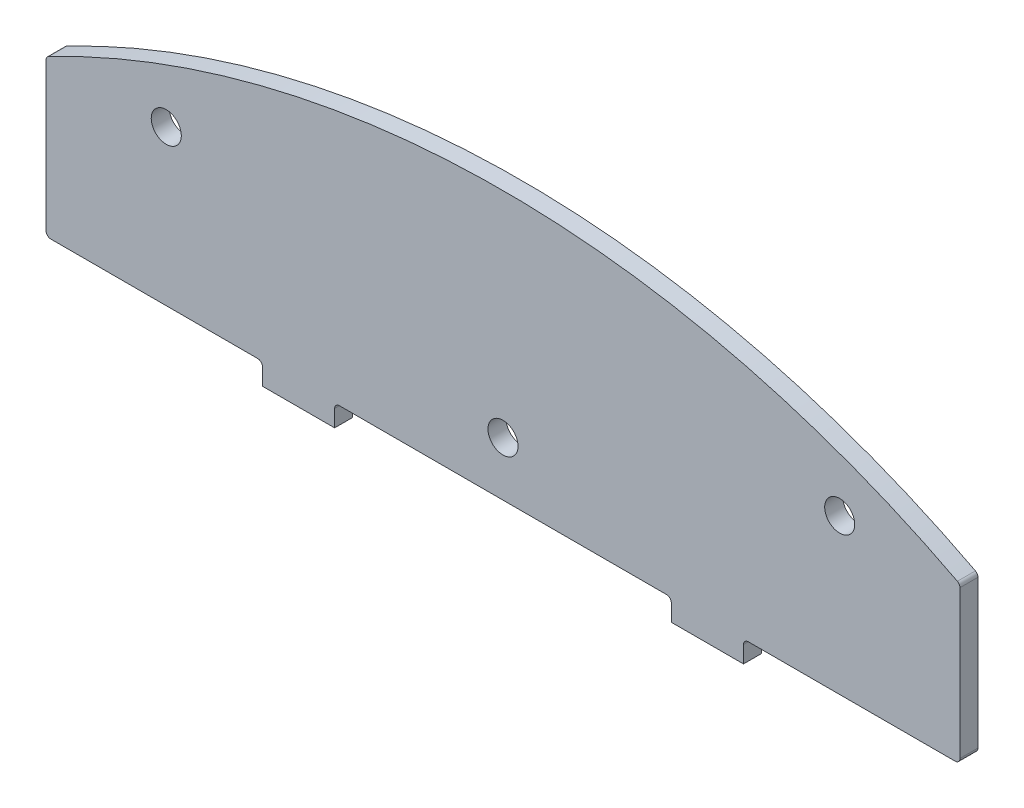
ISO-10303-21;
HEADER;
FILE_DESCRIPTION(('STEP AP214'),'2;1');
FILE_NAME('part.step','',(''),(''),'','','');
FILE_SCHEMA(('AUTOMOTIVE_DESIGN { 1 0 10303 214 1 1 1 1 }'));
ENDSEC;
DATA;
#1=APPLICATION_CONTEXT('core data for automotive mechanical design processes');
#2=APPLICATION_PROTOCOL_DEFINITION('international standard','automotive_design',2000,#1);
#3=PRODUCT_CONTEXT('',#1,'mechanical');
#4=PRODUCT('Part','Part','',(#3));
#5=PRODUCT_RELATED_PRODUCT_CATEGORY('part','',(#4));
#6=PRODUCT_DEFINITION_FORMATION('','',#4);
#7=PRODUCT_DEFINITION_CONTEXT('part definition',#1,'design');
#8=PRODUCT_DEFINITION('design','',#6,#7);
#9=PRODUCT_DEFINITION_SHAPE('','',#8);
#10=(LENGTH_UNIT() NAMED_UNIT(*) SI_UNIT(.MILLI.,.METRE.));
#11=(NAMED_UNIT(*) PLANE_ANGLE_UNIT() SI_UNIT($,.RADIAN.));
#12=(NAMED_UNIT(*) SI_UNIT($,.STERADIAN.) SOLID_ANGLE_UNIT());
#13=UNCERTAINTY_MEASURE_WITH_UNIT(LENGTH_MEASURE(1.E-05),#10,'distance_accuracy_value','');
#14=(GEOMETRIC_REPRESENTATION_CONTEXT(3) GLOBAL_UNCERTAINTY_ASSIGNED_CONTEXT((#13)) GLOBAL_UNIT_ASSIGNED_CONTEXT((#10,
#11,#12)) REPRESENTATION_CONTEXT('',''));
#15=CARTESIAN_POINT('',(0.,0.,0.));
#16=DIRECTION('',(0.,0.,1.));
#17=DIRECTION('',(1.,0.,0.));
#18=AXIS2_PLACEMENT_3D('',#15,#16,#17);
#19=CARTESIAN_POINT('',(0.,0.,4.7625));
#20=DIRECTION('',(0.,0.,1.));
#21=DIRECTION('',(1.,0.,0.));
#22=AXIS2_PLACEMENT_3D('',#19,#20,#21);
#23=PLANE('',#22);
#24=CARTESIAN_POINT('',(88.8995268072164,229.782459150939,4.7625));
#25=DIRECTION('',(0.,0.,-1.));
#26=DIRECTION('',(-1.,0.,0.));
#27=AXIS2_PLACEMENT_3D('',#24,#25,#26);
#28=CIRCLE('',#27,3.96874999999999);
#29=CARTESIAN_POINT('',(84.9307768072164,229.782459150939,4.7625));
#30=VERTEX_POINT('',#29);
#31=EDGE_CURVE('E376',#30,#30,#28,.T.);
#32=ORIENTED_EDGE('',*,*,#31,.T.);
#33=EDGE_LOOP('',(#32));
#34=FACE_BOUND('',#33,.T.);
#35=DIRECTION('',(0.,-1.,0.));
#36=VECTOR('',#35,1.);
#37=CARTESIAN_POINT('',(-120.65,229.990127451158,4.7625));
#38=LINE('',#37,#36);
#39=CARTESIAN_POINT('',(-120.65,229.220927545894,4.7625));
#40=VERTEX_POINT('',#39);
#41=CARTESIAN_POINT('',(-120.65,190.1825,4.7625));
#42=VERTEX_POINT('',#41);
#43=EDGE_CURVE('E354',#40,#42,#38,.T.);
#44=ORIENTED_EDGE('',*,*,#43,.T.);
#45=CARTESIAN_POINT('',(-119.38,190.1825,4.7625));
#46=DIRECTION('',(0.,0.,1.));
#47=DIRECTION('',(1.,0.,0.));
#48=AXIS2_PLACEMENT_3D('',#45,#46,#47);
#49=CIRCLE('',#48,1.27);
#50=CARTESIAN_POINT('',(-119.38,188.9125,4.7625));
#51=VERTEX_POINT('',#50);
#52=EDGE_CURVE('E224',#42,#51,#49,.T.);
#53=ORIENTED_EDGE('',*,*,#52,.T.);
#54=DIRECTION('',(1.,0.,0.));
#55=VECTOR('',#54,1.);
#56=CARTESIAN_POINT('',(-120.65,188.9125,4.7625));
#57=LINE('',#56,#55);
#58=CARTESIAN_POINT('',(-64.77,188.9125,4.7625));
#59=VERTEX_POINT('',#58);
#60=EDGE_CURVE('E322',#51,#59,#57,.T.);
#61=ORIENTED_EDGE('',*,*,#60,.T.);
#62=CARTESIAN_POINT('',(-64.77,187.6425,4.7625));
#63=DIRECTION('',(0.,0.,1.));
#64=DIRECTION('',(1.,0.,0.));
#65=AXIS2_PLACEMENT_3D('',#62,#63,#64);
#66=CIRCLE('',#65,1.27);
#67=CARTESIAN_POINT('',(-63.5,187.6425,4.7625));
#68=VERTEX_POINT('',#67);
#69=EDGE_CURVE('E11',#59,#68,#66,.F.);
#70=ORIENTED_EDGE('',*,*,#69,.T.);
#71=DIRECTION('',(0.,-1.,0.));
#72=VECTOR('',#71,1.);
#73=CARTESIAN_POINT('',(-63.5,188.9125,4.7625));
#74=LINE('',#73,#72);
#75=CARTESIAN_POINT('',(-63.5,183.20424729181,4.7625));
#76=VERTEX_POINT('',#75);
#77=EDGE_CURVE('E170',#68,#76,#74,.T.);
#78=ORIENTED_EDGE('',*,*,#77,.T.);
#79=DIRECTION('',(1.,0.,0.));
#80=VECTOR('',#79,1.);
#81=CARTESIAN_POINT('',(-63.5,183.20424729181,4.7625));
#82=LINE('',#81,#80);
#83=CARTESIAN_POINT('',(-44.45,183.20424729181,4.7625));
#84=VERTEX_POINT('',#83);
#85=EDGE_CURVE('E175',#76,#84,#82,.T.);
#86=ORIENTED_EDGE('',*,*,#85,.T.);
#87=DIRECTION('',(0.,1.,0.));
#88=VECTOR('',#87,1.);
#89=CARTESIAN_POINT('',(-44.45,188.9125,4.7625));
#90=LINE('',#89,#88);
#91=CARTESIAN_POINT('',(-44.45,187.6425,4.7625));
#92=VERTEX_POINT('',#91);
#93=EDGE_CURVE('E191',#84,#92,#90,.T.);
#94=ORIENTED_EDGE('',*,*,#93,.T.);
#95=CARTESIAN_POINT('',(-43.18,187.6425,4.7625));
#96=DIRECTION('',(0.,0.,1.));
#97=DIRECTION('',(1.,0.,0.));
#98=AXIS2_PLACEMENT_3D('',#95,#96,#97);
#99=CIRCLE('',#98,1.27);
#100=CARTESIAN_POINT('',(-43.18,188.9125,4.7625));
#101=VERTEX_POINT('',#100);
#102=EDGE_CURVE('E263',#92,#101,#99,.F.);
#103=ORIENTED_EDGE('',*,*,#102,.T.);
#104=DIRECTION('',(1.,0.,0.));
#105=VECTOR('',#104,1.);
#106=CARTESIAN_POINT('',(-44.45,188.9125,4.7625));
#107=LINE('',#106,#105);
#108=CARTESIAN_POINT('',(43.18,188.9125,4.7625));
#109=VERTEX_POINT('',#108);
#110=EDGE_CURVE('E274',#101,#109,#107,.T.);
#111=ORIENTED_EDGE('',*,*,#110,.T.);
#112=CARTESIAN_POINT('',(43.18,187.6425,4.7625));
#113=DIRECTION('',(0.,0.,1.));
#114=DIRECTION('',(1.,0.,0.));
#115=AXIS2_PLACEMENT_3D('',#112,#113,#114);
#116=CIRCLE('',#115,1.27);
#117=CARTESIAN_POINT('',(44.45,187.6425,4.7625));
#118=VERTEX_POINT('',#117);
#119=EDGE_CURVE('E267',#109,#118,#116,.F.);
#120=ORIENTED_EDGE('',*,*,#119,.T.);
#121=DIRECTION('',(0.,-1.,0.));
#122=VECTOR('',#121,1.);
#123=CARTESIAN_POINT('',(44.45,188.9125,4.7625));
#124=LINE('',#123,#122);
#125=CARTESIAN_POINT('',(44.45,183.20424729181,4.7625));
#126=VERTEX_POINT('',#125);
#127=EDGE_CURVE('E271',#118,#126,#124,.T.);
#128=ORIENTED_EDGE('',*,*,#127,.T.);
#129=DIRECTION('',(1.,0.,0.));
#130=VECTOR('',#129,1.);
#131=CARTESIAN_POINT('',(63.5,183.20424729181,4.7625));
#132=LINE('',#131,#130);
#133=CARTESIAN_POINT('',(63.5,183.20424729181,4.7625));
#134=VERTEX_POINT('',#133);
#135=EDGE_CURVE('E283',#126,#134,#132,.T.);
#136=ORIENTED_EDGE('',*,*,#135,.T.);
#137=DIRECTION('',(0.,1.,0.));
#138=VECTOR('',#137,1.);
#139=CARTESIAN_POINT('',(63.5,188.9125,4.7625));
#140=LINE('',#139,#138);
#141=CARTESIAN_POINT('',(63.5,187.6425,4.7625));
#142=VERTEX_POINT('',#141);
#143=EDGE_CURVE('E339',#134,#142,#140,.T.);
#144=ORIENTED_EDGE('',*,*,#143,.T.);
#145=CARTESIAN_POINT('',(64.77,187.6425,4.7625));
#146=DIRECTION('',(0.,0.,1.));
#147=DIRECTION('',(1.,0.,0.));
#148=AXIS2_PLACEMENT_3D('',#145,#146,#147);
#149=CIRCLE('',#148,1.27);
#150=CARTESIAN_POINT('',(64.77,188.9125,4.7625));
#151=VERTEX_POINT('',#150);
#152=EDGE_CURVE('E259',#142,#151,#149,.F.);
#153=ORIENTED_EDGE('',*,*,#152,.T.);
#154=DIRECTION('',(1.,0.,0.));
#155=VECTOR('',#154,1.);
#156=CARTESIAN_POINT('',(120.65,188.9125,4.7625));
#157=LINE('',#156,#155);
#158=CARTESIAN_POINT('',(119.38,188.9125,4.7625));
#159=VERTEX_POINT('',#158);
#160=EDGE_CURVE('E338',#151,#159,#157,.T.);
#161=ORIENTED_EDGE('',*,*,#160,.T.);
#162=CARTESIAN_POINT('',(119.38,190.1825,4.7625));
#163=DIRECTION('',(0.,0.,1.));
#164=DIRECTION('',(1.,0.,0.));
#165=AXIS2_PLACEMENT_3D('',#162,#163,#164);
#166=CIRCLE('',#165,1.27);
#167=CARTESIAN_POINT('',(120.65,190.1825,4.7625));
#168=VERTEX_POINT('',#167);
#169=EDGE_CURVE('E218',#159,#168,#166,.T.);
#170=ORIENTED_EDGE('',*,*,#169,.T.);
#171=DIRECTION('',(0.,1.,0.));
#172=VECTOR('',#171,1.);
#173=CARTESIAN_POINT('',(120.65,229.990127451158,4.7625));
#174=LINE('',#173,#172);
#175=CARTESIAN_POINT('',(120.65,229.220927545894,4.7625));
#176=VERTEX_POINT('',#175);
#177=EDGE_CURVE('E344',#168,#176,#174,.T.);
#178=ORIENTED_EDGE('',*,*,#177,.T.);
#179=CARTESIAN_POINT('',(119.38,229.220927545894,4.7625));
#180=DIRECTION('',(0.,0.,1.));
#181=DIRECTION('',(1.,0.,0.));
#182=AXIS2_PLACEMENT_3D('',#179,#180,#181);
#183=CIRCLE('',#182,1.27);
#184=CARTESIAN_POINT('',(119.966633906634,230.347320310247,4.7625));
#185=VERTEX_POINT('',#184);
#186=EDGE_CURVE('E220',#176,#185,#183,.T.);
#187=ORIENTED_EDGE('',*,*,#186,.T.);
#188=CARTESIAN_POINT('',(0.,0.,4.7625));
#189=DIRECTION('',(0.,0.,1.));
#190=DIRECTION('',(1.,0.,0.));
#191=AXIS2_PLACEMENT_3D('',#188,#189,#190);
#192=CIRCLE('',#191,259.715);
#193=CARTESIAN_POINT('',(-119.966633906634,230.347320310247,4.7625));
#194=VERTEX_POINT('',#193);
#195=EDGE_CURVE('E347',#185,#194,#192,.T.);
#196=ORIENTED_EDGE('',*,*,#195,.T.);
#197=CARTESIAN_POINT('',(-119.38,229.220927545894,4.7625));
#198=DIRECTION('',(0.,0.,1.));
#199=DIRECTION('',(1.,0.,0.));
#200=AXIS2_PLACEMENT_3D('',#197,#198,#199);
#201=CIRCLE('',#200,1.27);
#202=EDGE_CURVE('E222',#194,#40,#201,.T.);
#203=ORIENTED_EDGE('',*,*,#202,.T.);
#204=EDGE_LOOP('',(#44,#53,#61,#70,#78,#86,#94,#103,#111,#120,#128,#136,#144,#153,#161,#170,
#178,#187,#196,#203));
#205=FACE_BOUND('',#204,.T.);
#206=CARTESIAN_POINT('',(-88.9004731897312,229.783501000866,4.7625));
#207=DIRECTION('',(0.,0.,-1.));
#208=DIRECTION('',(-1.,0.,0.));
#209=AXIS2_PLACEMENT_3D('',#206,#207,#208);
#210=CIRCLE('',#209,3.96874999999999);
#211=CARTESIAN_POINT('',(-92.8692231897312,229.783501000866,4.7625));
#212=VERTEX_POINT('',#211);
#213=EDGE_CURVE('E370',#212,#212,#210,.T.);
#214=ORIENTED_EDGE('',*,*,#213,.T.);
#215=EDGE_LOOP('',(#214));
#216=FACE_BOUND('',#215,.T.);
#217=CARTESIAN_POINT('',(0.,203.2,4.7625));
#218=DIRECTION('',(0.,0.,-1.));
#219=DIRECTION('',(-1.,0.,0.));
#220=AXIS2_PLACEMENT_3D('',#217,#218,#219);
#221=CIRCLE('',#220,3.96875);
#222=CARTESIAN_POINT('',(-3.96874999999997,203.2,4.7625));
#223=VERTEX_POINT('',#222);
#224=EDGE_CURVE('E382',#223,#223,#221,.T.);
#225=ORIENTED_EDGE('',*,*,#224,.T.);
#226=EDGE_LOOP('',(#225));
#227=FACE_BOUND('',#226,.T.);
#228=ADVANCED_FACE('F34',(#34,#205,#216,#227),#23,.T.);
#229=CARTESIAN_POINT('',(-63.5,188.9125,4.7625));
#230=DIRECTION('',(1.,0.,0.));
#231=DIRECTION('',(0.,0.,-1.));
#232=AXIS2_PLACEMENT_3D('',#229,#230,#231);
#233=PLANE('',#232);
#234=ORIENTED_EDGE('',*,*,#77,.F.);
#235=DIRECTION('',(0.,0.,-1.));
#236=VECTOR('',#235,1.);
#237=CARTESIAN_POINT('',(-63.5,187.6425,0.));
#238=LINE('',#237,#236);
#239=CARTESIAN_POINT('',(-63.5,187.6425,0.));
#240=VERTEX_POINT('',#239);
#241=EDGE_CURVE('E254',#68,#240,#238,.T.);
#242=ORIENTED_EDGE('',*,*,#241,.T.);
#243=DIRECTION('',(0.,-1.,0.));
#244=VECTOR('',#243,1.);
#245=CARTESIAN_POINT('',(-63.5,188.9125,0.));
#246=LINE('',#245,#244);
#247=CARTESIAN_POINT('',(-63.5,183.20424729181,0.));
#248=VERTEX_POINT('',#247);
#249=EDGE_CURVE('E194',#240,#248,#246,.T.);
#250=ORIENTED_EDGE('',*,*,#249,.T.);
#251=DIRECTION('',(0.,0.,-1.));
#252=VECTOR('',#251,1.);
#253=CARTESIAN_POINT('',(-63.5,183.20424729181,4.7625));
#254=LINE('',#253,#252);
#255=EDGE_CURVE('E187',#76,#248,#254,.T.);
#256=ORIENTED_EDGE('',*,*,#255,.F.);
#257=EDGE_LOOP('',(#234,#242,#250,#256));
#258=FACE_BOUND('',#257,.T.);
#259=ADVANCED_FACE('F193',(#258),#233,.F.);
#260=CARTESIAN_POINT('',(-63.5,183.20424729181,4.7625));
#261=DIRECTION('',(0.,1.,0.));
#262=DIRECTION('',(0.,0.,1.));
#263=AXIS2_PLACEMENT_3D('',#260,#261,#262);
#264=PLANE('',#263);
#265=DIRECTION('',(1.,0.,0.));
#266=VECTOR('',#265,1.);
#267=CARTESIAN_POINT('',(-63.5,183.20424729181,0.));
#268=LINE('',#267,#266);
#269=CARTESIAN_POINT('',(-44.45,183.20424729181,0.));
#270=VERTEX_POINT('',#269);
#271=EDGE_CURVE('E300',#248,#270,#268,.T.);
#272=ORIENTED_EDGE('',*,*,#271,.T.);
#273=DIRECTION('',(0.,0.,-1.));
#274=VECTOR('',#273,1.);
#275=CARTESIAN_POINT('',(-44.45,183.20424729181,4.7625));
#276=LINE('',#275,#274);
#277=EDGE_CURVE('E189',#84,#270,#276,.T.);
#278=ORIENTED_EDGE('',*,*,#277,.F.);
#279=ORIENTED_EDGE('',*,*,#85,.F.);
#280=ORIENTED_EDGE('',*,*,#255,.T.);
#281=EDGE_LOOP('',(#272,#278,#279,#280));
#282=FACE_BOUND('',#281,.T.);
#283=ADVANCED_FACE('F186',(#282),#264,.F.);
#284=CARTESIAN_POINT('',(-44.45,188.9125,4.7625));
#285=DIRECTION('',(-1.,0.,0.));
#286=DIRECTION('',(0.,0.,1.));
#287=AXIS2_PLACEMENT_3D('',#284,#285,#286);
#288=PLANE('',#287);
#289=DIRECTION('',(0.,1.,0.));
#290=VECTOR('',#289,1.);
#291=CARTESIAN_POINT('',(-44.45,188.9125,0.));
#292=LINE('',#291,#290);
#293=CARTESIAN_POINT('',(-44.45,187.6425,0.));
#294=VERTEX_POINT('',#293);
#295=EDGE_CURVE('E295',#270,#294,#292,.T.);
#296=ORIENTED_EDGE('',*,*,#295,.T.);
#297=DIRECTION('',(0.,0.,-1.));
#298=VECTOR('',#297,1.);
#299=CARTESIAN_POINT('',(-44.45,187.6425,4.7625));
#300=LINE('',#299,#298);
#301=EDGE_CURVE('E249',#294,#92,#300,.F.);
#302=ORIENTED_EDGE('',*,*,#301,.T.);
#303=ORIENTED_EDGE('',*,*,#93,.F.);
#304=ORIENTED_EDGE('',*,*,#277,.T.);
#305=EDGE_LOOP('',(#296,#302,#303,#304));
#306=FACE_BOUND('',#305,.T.);
#307=ADVANCED_FACE('F360',(#306),#288,.F.);
#308=CARTESIAN_POINT('',(-44.45,188.9125,4.7625));
#309=DIRECTION('',(0.,1.,0.));
#310=DIRECTION('',(0.,0.,1.));
#311=AXIS2_PLACEMENT_3D('',#308,#309,#310);
#312=PLANE('',#311);
#313=ORIENTED_EDGE('',*,*,#110,.F.);
#314=DIRECTION('',(0.,0.,-1.));
#315=VECTOR('',#314,1.);
#316=CARTESIAN_POINT('',(-43.18,188.9125,0.));
#317=LINE('',#316,#315);
#318=CARTESIAN_POINT('',(-43.18,188.9125,0.));
#319=VERTEX_POINT('',#318);
#320=EDGE_CURVE('E246',#101,#319,#317,.T.);
#321=ORIENTED_EDGE('',*,*,#320,.T.);
#322=DIRECTION('',(1.,0.,0.));
#323=VECTOR('',#322,1.);
#324=CARTESIAN_POINT('',(-44.45,188.9125,0.));
#325=LINE('',#324,#323);
#326=CARTESIAN_POINT('',(43.18,188.9125,0.));
#327=VERTEX_POINT('',#326);
#328=EDGE_CURVE('E289',#319,#327,#325,.T.);
#329=ORIENTED_EDGE('',*,*,#328,.T.);
#330=DIRECTION('',(0.,0.,-1.));
#331=VECTOR('',#330,1.);
#332=CARTESIAN_POINT('',(43.18,188.9125,4.7625));
#333=LINE('',#332,#331);
#334=EDGE_CURVE('E244',#327,#109,#333,.F.);
#335=ORIENTED_EDGE('',*,*,#334,.T.);
#336=EDGE_LOOP('',(#313,#321,#329,#335));
#337=FACE_BOUND('',#336,.T.);
#338=ADVANCED_FACE('F293',(#337),#312,.F.);
#339=CARTESIAN_POINT('',(44.45,188.9125,4.7625));
#340=DIRECTION('',(1.,0.,0.));
#341=DIRECTION('',(0.,0.,-1.));
#342=AXIS2_PLACEMENT_3D('',#339,#340,#341);
#343=PLANE('',#342);
#344=ORIENTED_EDGE('',*,*,#127,.F.);
#345=DIRECTION('',(0.,0.,-1.));
#346=VECTOR('',#345,1.);
#347=CARTESIAN_POINT('',(44.45,187.6425,0.));
#348=LINE('',#347,#346);
#349=CARTESIAN_POINT('',(44.45,187.6425,0.));
#350=VERTEX_POINT('',#349);
#351=EDGE_CURVE('E251',#118,#350,#348,.T.);
#352=ORIENTED_EDGE('',*,*,#351,.T.);
#353=DIRECTION('',(0.,-1.,0.));
#354=VECTOR('',#353,1.);
#355=CARTESIAN_POINT('',(44.45,188.9125,0.));
#356=LINE('',#355,#354);
#357=CARTESIAN_POINT('',(44.45,183.20424729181,0.));
#358=VERTEX_POINT('',#357);
#359=EDGE_CURVE('E291',#350,#358,#356,.T.);
#360=ORIENTED_EDGE('',*,*,#359,.T.);
#361=DIRECTION('',(0.,0.,-1.));
#362=VECTOR('',#361,1.);
#363=CARTESIAN_POINT('',(44.45,183.20424729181,4.7625));
#364=LINE('',#363,#362);
#365=EDGE_CURVE('E201',#126,#358,#364,.T.);
#366=ORIENTED_EDGE('',*,*,#365,.F.);
#367=EDGE_LOOP('',(#344,#352,#360,#366));
#368=FACE_BOUND('',#367,.T.);
#369=ADVANCED_FACE('F279',(#368),#343,.F.);
#370=CARTESIAN_POINT('',(63.5,183.20424729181,4.7625));
#371=DIRECTION('',(0.,1.,0.));
#372=DIRECTION('',(0.,0.,1.));
#373=AXIS2_PLACEMENT_3D('',#370,#371,#372);
#374=PLANE('',#373);
#375=DIRECTION('',(1.,0.,0.));
#376=VECTOR('',#375,1.);
#377=CARTESIAN_POINT('',(63.5,183.20424729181,0.));
#378=LINE('',#377,#376);
#379=CARTESIAN_POINT('',(63.5,183.20424729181,0.));
#380=VERTEX_POINT('',#379);
#381=EDGE_CURVE('E297',#358,#380,#378,.T.);
#382=ORIENTED_EDGE('',*,*,#381,.T.);
#383=DIRECTION('',(0.,0.,-1.));
#384=VECTOR('',#383,1.);
#385=CARTESIAN_POINT('',(63.5,183.20424729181,4.7625));
#386=LINE('',#385,#384);
#387=EDGE_CURVE('E320',#134,#380,#386,.T.);
#388=ORIENTED_EDGE('',*,*,#387,.F.);
#389=ORIENTED_EDGE('',*,*,#135,.F.);
#390=ORIENTED_EDGE('',*,*,#365,.T.);
#391=EDGE_LOOP('',(#382,#388,#389,#390));
#392=FACE_BOUND('',#391,.T.);
#393=ADVANCED_FACE('F324',(#392),#374,.F.);
#394=CARTESIAN_POINT('',(63.5,188.9125,4.7625));
#395=DIRECTION('',(-1.,0.,0.));
#396=DIRECTION('',(0.,0.,1.));
#397=AXIS2_PLACEMENT_3D('',#394,#395,#396);
#398=PLANE('',#397);
#399=DIRECTION('',(0.,1.,0.));
#400=VECTOR('',#399,1.);
#401=CARTESIAN_POINT('',(63.5,188.9125,0.));
#402=LINE('',#401,#400);
#403=CARTESIAN_POINT('',(63.5,187.6425,0.));
#404=VERTEX_POINT('',#403);
#405=EDGE_CURVE('E305',#380,#404,#402,.T.);
#406=ORIENTED_EDGE('',*,*,#405,.T.);
#407=DIRECTION('',(0.,0.,-1.));
#408=VECTOR('',#407,1.);
#409=CARTESIAN_POINT('',(63.5,187.6425,4.7625));
#410=LINE('',#409,#408);
#411=EDGE_CURVE('E242',#404,#142,#410,.F.);
#412=ORIENTED_EDGE('',*,*,#411,.T.);
#413=ORIENTED_EDGE('',*,*,#143,.F.);
#414=ORIENTED_EDGE('',*,*,#387,.T.);
#415=EDGE_LOOP('',(#406,#412,#413,#414));
#416=FACE_BOUND('',#415,.T.);
#417=ADVANCED_FACE('F330',(#416),#398,.F.);
#418=CARTESIAN_POINT('',(120.65,188.9125,4.7625));
#419=DIRECTION('',(0.,1.,0.));
#420=DIRECTION('',(0.,0.,1.));
#421=AXIS2_PLACEMENT_3D('',#418,#419,#420);
#422=PLANE('',#421);
#423=ORIENTED_EDGE('',*,*,#160,.F.);
#424=DIRECTION('',(0.,0.,-1.));
#425=VECTOR('',#424,1.);
#426=CARTESIAN_POINT('',(64.77,188.9125,0.));
#427=LINE('',#426,#425);
#428=CARTESIAN_POINT('',(64.77,188.9125,0.));
#429=VERTEX_POINT('',#428);
#430=EDGE_CURVE('E239',#151,#429,#427,.T.);
#431=ORIENTED_EDGE('',*,*,#430,.T.);
#432=DIRECTION('',(1.,0.,0.));
#433=VECTOR('',#432,1.);
#434=CARTESIAN_POINT('',(120.65,188.9125,0.));
#435=LINE('',#434,#433);
#436=CARTESIAN_POINT('',(119.38,188.9125,0.));
#437=VERTEX_POINT('',#436);
#438=EDGE_CURVE('E308',#429,#437,#435,.T.);
#439=ORIENTED_EDGE('',*,*,#438,.T.);
#440=DIRECTION('',(0.,0.,-1.));
#441=VECTOR('',#440,1.);
#442=CARTESIAN_POINT('',(119.38,188.9125,4.7625));
#443=LINE('',#442,#441);
#444=EDGE_CURVE('E236',#437,#159,#443,.F.);
#445=ORIENTED_EDGE('',*,*,#444,.T.);
#446=EDGE_LOOP('',(#423,#431,#439,#445));
#447=FACE_BOUND('',#446,.T.);
#448=ADVANCED_FACE('F341',(#447),#422,.F.);
#449=CARTESIAN_POINT('',(120.65,229.990127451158,4.7625));
#450=DIRECTION('',(-1.,0.,0.));
#451=DIRECTION('',(0.,0.,1.));
#452=AXIS2_PLACEMENT_3D('',#449,#450,#451);
#453=PLANE('',#452);
#454=DIRECTION('',(0.,1.,0.));
#455=VECTOR('',#454,1.);
#456=CARTESIAN_POINT('',(120.65,229.990127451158,0.));
#457=LINE('',#456,#455);
#458=CARTESIAN_POINT('',(120.65,190.1825,0.));
#459=VERTEX_POINT('',#458);
#460=CARTESIAN_POINT('',(120.65,229.220927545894,0.));
#461=VERTEX_POINT('',#460);
#462=EDGE_CURVE('E310',#459,#461,#457,.T.);
#463=ORIENTED_EDGE('',*,*,#462,.T.);
#464=DIRECTION('',(0.,0.,-1.));
#465=VECTOR('',#464,1.);
#466=CARTESIAN_POINT('',(120.65,229.220927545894,4.7625));
#467=LINE('',#466,#465);
#468=EDGE_CURVE('E234',#461,#176,#467,.F.);
#469=ORIENTED_EDGE('',*,*,#468,.T.);
#470=ORIENTED_EDGE('',*,*,#177,.F.);
#471=DIRECTION('',(0.,0.,-1.));
#472=VECTOR('',#471,1.);
#473=CARTESIAN_POINT('',(120.65,190.1825,4.7625));
#474=LINE('',#473,#472);
#475=EDGE_CURVE('E231',#168,#459,#474,.T.);
#476=ORIENTED_EDGE('',*,*,#475,.T.);
#477=EDGE_LOOP('',(#463,#469,#470,#476));
#478=FACE_BOUND('',#477,.T.);
#479=ADVANCED_FACE('F430',(#478),#453,.F.);
#480=CARTESIAN_POINT('',(0.,0.,4.7625));
#481=DIRECTION('',(0.,0.,-1.));
#482=DIRECTION('',(-1.,0.,0.));
#483=AXIS2_PLACEMENT_3D('',#480,#481,#482);
#484=CYLINDRICAL_SURFACE('',#483,259.715);
#485=CARTESIAN_POINT('',(0.,0.,0.));
#486=DIRECTION('',(0.,0.,1.));
#487=DIRECTION('',(1.,0.,0.));
#488=AXIS2_PLACEMENT_3D('',#485,#486,#487);
#489=CIRCLE('',#488,259.715);
#490=CARTESIAN_POINT('',(119.966633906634,230.347320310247,0.));
#491=VERTEX_POINT('',#490);
#492=CARTESIAN_POINT('',(-119.966633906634,230.347320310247,0.));
#493=VERTEX_POINT('',#492);
#494=EDGE_CURVE('E313',#491,#493,#489,.T.);
#495=ORIENTED_EDGE('',*,*,#494,.T.);
#496=DIRECTION('',(0.,0.,-1.));
#497=VECTOR('',#496,1.);
#498=CARTESIAN_POINT('',(-119.966633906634,230.347320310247,4.7625));
#499=LINE('',#498,#497);
#500=EDGE_CURVE('E229',#493,#194,#499,.F.);
#501=ORIENTED_EDGE('',*,*,#500,.T.);
#502=ORIENTED_EDGE('',*,*,#195,.F.);
#503=DIRECTION('',(0.,0.,-1.));
#504=VECTOR('',#503,1.);
#505=CARTESIAN_POINT('',(119.966633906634,230.347320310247,4.7625));
#506=LINE('',#505,#504);
#507=EDGE_CURVE('E226',#185,#491,#506,.T.);
#508=ORIENTED_EDGE('',*,*,#507,.T.);
#509=EDGE_LOOP('',(#495,#501,#502,#508));
#510=FACE_BOUND('',#509,.T.);
#511=ADVANCED_FACE('F426',(#510),#484,.T.);
#512=CARTESIAN_POINT('',(-120.65,229.990127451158,4.7625));
#513=DIRECTION('',(1.,0.,0.));
#514=DIRECTION('',(0.,0.,-1.));
#515=AXIS2_PLACEMENT_3D('',#512,#513,#514);
#516=PLANE('',#515);
#517=DIRECTION('',(0.,-1.,0.));
#518=VECTOR('',#517,1.);
#519=CARTESIAN_POINT('',(-120.65,229.990127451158,0.));
#520=LINE('',#519,#518);
#521=CARTESIAN_POINT('',(-120.65,229.220927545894,0.));
#522=VERTEX_POINT('',#521);
#523=CARTESIAN_POINT('',(-120.65,190.1825,0.));
#524=VERTEX_POINT('',#523);
#525=EDGE_CURVE('E316',#522,#524,#520,.T.);
#526=ORIENTED_EDGE('',*,*,#525,.T.);
#527=DIRECTION('',(0.,0.,-1.));
#528=VECTOR('',#527,1.);
#529=CARTESIAN_POINT('',(-120.65,190.1825,4.7625));
#530=LINE('',#529,#528);
#531=EDGE_CURVE('E216',#524,#42,#530,.F.);
#532=ORIENTED_EDGE('',*,*,#531,.T.);
#533=ORIENTED_EDGE('',*,*,#43,.F.);
#534=DIRECTION('',(0.,0.,-1.));
#535=VECTOR('',#534,1.);
#536=CARTESIAN_POINT('',(-120.65,229.220927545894,4.7625));
#537=LINE('',#536,#535);
#538=EDGE_CURVE('E213',#40,#522,#537,.T.);
#539=ORIENTED_EDGE('',*,*,#538,.T.);
#540=EDGE_LOOP('',(#526,#532,#533,#539));
#541=FACE_BOUND('',#540,.T.);
#542=ADVANCED_FACE('F423',(#541),#516,.F.);
#543=CARTESIAN_POINT('',(-120.65,188.9125,4.7625));
#544=DIRECTION('',(0.,1.,0.));
#545=DIRECTION('',(0.,0.,1.));
#546=AXIS2_PLACEMENT_3D('',#543,#544,#545);
#547=PLANE('',#546);
#548=DIRECTION('',(1.,0.,0.));
#549=VECTOR('',#548,1.);
#550=CARTESIAN_POINT('',(-120.65,188.9125,0.));
#551=LINE('',#550,#549);
#552=CARTESIAN_POINT('',(-119.38,188.9125,0.));
#553=VERTEX_POINT('',#552);
#554=CARTESIAN_POINT('',(-64.77,188.9125,0.));
#555=VERTEX_POINT('',#554);
#556=EDGE_CURVE('E182',#553,#555,#551,.T.);
#557=ORIENTED_EDGE('',*,*,#556,.T.);
#558=DIRECTION('',(0.,0.,-1.));
#559=VECTOR('',#558,1.);
#560=CARTESIAN_POINT('',(-64.77,188.9125,4.7625));
#561=LINE('',#560,#559);
#562=EDGE_CURVE('E55',#555,#59,#561,.F.);
#563=ORIENTED_EDGE('',*,*,#562,.T.);
#564=ORIENTED_EDGE('',*,*,#60,.F.);
#565=DIRECTION('',(0.,0.,-1.));
#566=VECTOR('',#565,1.);
#567=CARTESIAN_POINT('',(-119.38,188.9125,4.7625));
#568=LINE('',#567,#566);
#569=EDGE_CURVE('E196',#51,#553,#568,.T.);
#570=ORIENTED_EDGE('',*,*,#569,.T.);
#571=EDGE_LOOP('',(#557,#563,#564,#570));
#572=FACE_BOUND('',#571,.T.);
#573=ADVANCED_FACE('F398',(#572),#547,.F.);
#574=CARTESIAN_POINT('',(0.,0.,0.));
#575=DIRECTION('',(0.,0.,1.));
#576=DIRECTION('',(1.,0.,0.));
#577=AXIS2_PLACEMENT_3D('',#574,#575,#576);
#578=PLANE('',#577);
#579=CARTESIAN_POINT('',(0.,203.2,0.));
#580=DIRECTION('',(0.,0.,-1.));
#581=DIRECTION('',(-1.,0.,0.));
#582=AXIS2_PLACEMENT_3D('',#579,#580,#581);
#583=CIRCLE('',#582,3.96875);
#584=CARTESIAN_POINT('',(-3.96874999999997,203.2,0.));
#585=VERTEX_POINT('',#584);
#586=EDGE_CURVE('E379',#585,#585,#583,.T.);
#587=ORIENTED_EDGE('',*,*,#586,.F.);
#588=EDGE_LOOP('',(#587));
#589=FACE_BOUND('',#588,.T.);
#590=CARTESIAN_POINT('',(88.8995268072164,229.782459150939,0.));
#591=DIRECTION('',(0.,0.,-1.));
#592=DIRECTION('',(-1.,0.,0.));
#593=AXIS2_PLACEMENT_3D('',#590,#591,#592);
#594=CIRCLE('',#593,3.96874999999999);
#595=CARTESIAN_POINT('',(84.9307768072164,229.782459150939,0.));
#596=VERTEX_POINT('',#595);
#597=EDGE_CURVE('E373',#596,#596,#594,.T.);
#598=ORIENTED_EDGE('',*,*,#597,.F.);
#599=EDGE_LOOP('',(#598));
#600=FACE_BOUND('',#599,.T.);
#601=CARTESIAN_POINT('',(-88.9004731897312,229.783501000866,0.));
#602=DIRECTION('',(0.,0.,-1.));
#603=DIRECTION('',(-1.,0.,0.));
#604=AXIS2_PLACEMENT_3D('',#601,#602,#603);
#605=CIRCLE('',#604,3.96874999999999);
#606=CARTESIAN_POINT('',(-92.8692231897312,229.783501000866,0.));
#607=VERTEX_POINT('',#606);
#608=EDGE_CURVE('E357',#607,#607,#605,.T.);
#609=ORIENTED_EDGE('',*,*,#608,.F.);
#610=EDGE_LOOP('',(#609));
#611=FACE_BOUND('',#610,.T.);
#612=ORIENTED_EDGE('',*,*,#556,.F.);
#613=CARTESIAN_POINT('',(-119.38,190.1825,0.));
#614=DIRECTION('',(0.,0.,1.));
#615=DIRECTION('',(1.,0.,0.));
#616=AXIS2_PLACEMENT_3D('',#613,#614,#615);
#617=CIRCLE('',#616,1.27);
#618=EDGE_CURVE('E211',#553,#524,#617,.F.);
#619=ORIENTED_EDGE('',*,*,#618,.T.);
#620=ORIENTED_EDGE('',*,*,#525,.F.);
#621=CARTESIAN_POINT('',(-119.38,229.220927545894,0.));
#622=DIRECTION('',(0.,0.,1.));
#623=DIRECTION('',(1.,0.,0.));
#624=AXIS2_PLACEMENT_3D('',#621,#622,#623);
#625=CIRCLE('',#624,1.27);
#626=EDGE_CURVE('E209',#522,#493,#625,.F.);
#627=ORIENTED_EDGE('',*,*,#626,.T.);
#628=ORIENTED_EDGE('',*,*,#494,.F.);
#629=CARTESIAN_POINT('',(119.38,229.220927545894,0.));
#630=DIRECTION('',(0.,0.,1.));
#631=DIRECTION('',(1.,0.,0.));
#632=AXIS2_PLACEMENT_3D('',#629,#630,#631);
#633=CIRCLE('',#632,1.27);
#634=EDGE_CURVE('E207',#491,#461,#633,.F.);
#635=ORIENTED_EDGE('',*,*,#634,.T.);
#636=ORIENTED_EDGE('',*,*,#462,.F.);
#637=CARTESIAN_POINT('',(119.38,190.1825,0.));
#638=DIRECTION('',(0.,0.,1.));
#639=DIRECTION('',(1.,0.,0.));
#640=AXIS2_PLACEMENT_3D('',#637,#638,#639);
#641=CIRCLE('',#640,1.27);
#642=EDGE_CURVE('E199',#459,#437,#641,.F.);
#643=ORIENTED_EDGE('',*,*,#642,.T.);
#644=ORIENTED_EDGE('',*,*,#438,.F.);
#645=CARTESIAN_POINT('',(64.77,187.6425,0.));
#646=DIRECTION('',(0.,0.,1.));
#647=DIRECTION('',(1.,0.,0.));
#648=AXIS2_PLACEMENT_3D('',#645,#646,#647);
#649=CIRCLE('',#648,1.27);
#650=EDGE_CURVE('E257',#429,#404,#649,.T.);
#651=ORIENTED_EDGE('',*,*,#650,.T.);
#652=ORIENTED_EDGE('',*,*,#405,.F.);
#653=ORIENTED_EDGE('',*,*,#381,.F.);
#654=ORIENTED_EDGE('',*,*,#359,.F.);
#655=CARTESIAN_POINT('',(43.18,187.6425,0.));
#656=DIRECTION('',(0.,0.,1.));
#657=DIRECTION('',(1.,0.,0.));
#658=AXIS2_PLACEMENT_3D('',#655,#656,#657);
#659=CIRCLE('',#658,1.27);
#660=EDGE_CURVE('E265',#350,#327,#659,.T.);
#661=ORIENTED_EDGE('',*,*,#660,.T.);
#662=ORIENTED_EDGE('',*,*,#328,.F.);
#663=CARTESIAN_POINT('',(-43.18,187.6425,0.));
#664=DIRECTION('',(0.,0.,1.));
#665=DIRECTION('',(1.,0.,0.));
#666=AXIS2_PLACEMENT_3D('',#663,#664,#665);
#667=CIRCLE('',#666,1.27);
#668=EDGE_CURVE('E261',#319,#294,#667,.T.);
#669=ORIENTED_EDGE('',*,*,#668,.T.);
#670=ORIENTED_EDGE('',*,*,#295,.F.);
#671=ORIENTED_EDGE('',*,*,#271,.F.);
#672=ORIENTED_EDGE('',*,*,#249,.F.);
#673=CARTESIAN_POINT('',(-64.77,187.6425,0.));
#674=DIRECTION('',(0.,0.,1.));
#675=DIRECTION('',(1.,0.,0.));
#676=AXIS2_PLACEMENT_3D('',#673,#674,#675);
#677=CIRCLE('',#676,1.27);
#678=EDGE_CURVE('E42',#240,#555,#677,.T.);
#679=ORIENTED_EDGE('',*,*,#678,.T.);
#680=EDGE_LOOP('',(#612,#619,#620,#627,#628,#635,#636,#643,#644,#651,#652,#653,#654,#661,#662,
#669,#670,#671,#672,#679));
#681=FACE_BOUND('',#680,.T.);
#682=ADVANCED_FACE('F288',(#589,#600,#611,#681),#578,.F.);
#683=CARTESIAN_POINT('',(-88.9004731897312,229.783501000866,0.));
#684=DIRECTION('',(0.,0.,-1.));
#685=DIRECTION('',(-1.,0.,0.));
#686=AXIS2_PLACEMENT_3D('',#683,#684,#685);
#687=CYLINDRICAL_SURFACE('',#686,3.96874999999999);
#688=ORIENTED_EDGE('',*,*,#213,.F.);
#689=EDGE_LOOP('',(#688));
#690=FACE_BOUND('',#689,.T.);
#691=ORIENTED_EDGE('',*,*,#608,.T.);
#692=EDGE_LOOP('',(#691));
#693=FACE_BOUND('',#692,.T.);
#694=ADVANCED_FACE('F397',(#690,#693),#687,.F.);
#695=CARTESIAN_POINT('',(88.8995268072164,229.782459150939,0.));
#696=DIRECTION('',(0.,0.,-1.));
#697=DIRECTION('',(-1.,0.,0.));
#698=AXIS2_PLACEMENT_3D('',#695,#696,#697);
#699=CYLINDRICAL_SURFACE('',#698,3.96874999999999);
#700=ORIENTED_EDGE('',*,*,#31,.F.);
#701=EDGE_LOOP('',(#700));
#702=FACE_BOUND('',#701,.T.);
#703=ORIENTED_EDGE('',*,*,#597,.T.);
#704=EDGE_LOOP('',(#703));
#705=FACE_BOUND('',#704,.T.);
#706=ADVANCED_FACE('F391',(#702,#705),#699,.F.);
#707=CARTESIAN_POINT('',(0.,203.2,0.));
#708=DIRECTION('',(0.,0.,-1.));
#709=DIRECTION('',(-1.,0.,0.));
#710=AXIS2_PLACEMENT_3D('',#707,#708,#709);
#711=CYLINDRICAL_SURFACE('',#710,3.96875);
#712=ORIENTED_EDGE('',*,*,#224,.F.);
#713=EDGE_LOOP('',(#712));
#714=FACE_BOUND('',#713,.T.);
#715=ORIENTED_EDGE('',*,*,#586,.T.);
#716=EDGE_LOOP('',(#715));
#717=FACE_BOUND('',#716,.T.);
#718=ADVANCED_FACE('F387',(#714,#717),#711,.F.);
#719=CARTESIAN_POINT('',(-119.38,190.1825,4.7625));
#720=DIRECTION('',(0.,0.,-1.));
#721=DIRECTION('',(-1.,0.,0.));
#722=AXIS2_PLACEMENT_3D('',#719,#720,#721);
#723=CYLINDRICAL_SURFACE('',#722,1.27);
#724=ORIENTED_EDGE('',*,*,#52,.F.);
#725=ORIENTED_EDGE('',*,*,#531,.F.);
#726=ORIENTED_EDGE('',*,*,#618,.F.);
#727=ORIENTED_EDGE('',*,*,#569,.F.);
#728=EDGE_LOOP('',(#724,#725,#726,#727));
#729=FACE_BOUND('',#728,.T.);
#730=ADVANCED_FACE('F390',(#729),#723,.T.);
#731=CARTESIAN_POINT('',(-119.38,229.220927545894,4.7625));
#732=DIRECTION('',(0.,0.,-1.));
#733=DIRECTION('',(-1.,0.,0.));
#734=AXIS2_PLACEMENT_3D('',#731,#732,#733);
#735=CYLINDRICAL_SURFACE('',#734,1.27);
#736=ORIENTED_EDGE('',*,*,#202,.F.);
#737=ORIENTED_EDGE('',*,*,#500,.F.);
#738=ORIENTED_EDGE('',*,*,#626,.F.);
#739=ORIENTED_EDGE('',*,*,#538,.F.);
#740=EDGE_LOOP('',(#736,#737,#738,#739));
#741=FACE_BOUND('',#740,.T.);
#742=ADVANCED_FACE('F451',(#741),#735,.T.);
#743=CARTESIAN_POINT('',(119.38,229.220927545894,4.7625));
#744=DIRECTION('',(0.,0.,-1.));
#745=DIRECTION('',(-1.,0.,0.));
#746=AXIS2_PLACEMENT_3D('',#743,#744,#745);
#747=CYLINDRICAL_SURFACE('',#746,1.27);
#748=ORIENTED_EDGE('',*,*,#186,.F.);
#749=ORIENTED_EDGE('',*,*,#468,.F.);
#750=ORIENTED_EDGE('',*,*,#634,.F.);
#751=ORIENTED_EDGE('',*,*,#507,.F.);
#752=EDGE_LOOP('',(#748,#749,#750,#751));
#753=FACE_BOUND('',#752,.T.);
#754=ADVANCED_FACE('F455',(#753),#747,.T.);
#755=CARTESIAN_POINT('',(119.38,190.1825,4.7625));
#756=DIRECTION('',(0.,0.,-1.));
#757=DIRECTION('',(-1.,0.,0.));
#758=AXIS2_PLACEMENT_3D('',#755,#756,#757);
#759=CYLINDRICAL_SURFACE('',#758,1.27);
#760=ORIENTED_EDGE('',*,*,#169,.F.);
#761=ORIENTED_EDGE('',*,*,#444,.F.);
#762=ORIENTED_EDGE('',*,*,#642,.F.);
#763=ORIENTED_EDGE('',*,*,#475,.F.);
#764=EDGE_LOOP('',(#760,#761,#762,#763));
#765=FACE_BOUND('',#764,.T.);
#766=ADVANCED_FACE('F459',(#765),#759,.T.);
#767=CARTESIAN_POINT('',(64.77,187.6425,4.7625));
#768=DIRECTION('',(0.,0.,1.));
#769=DIRECTION('',(1.,0.,0.));
#770=AXIS2_PLACEMENT_3D('',#767,#768,#769);
#771=CYLINDRICAL_SURFACE('',#770,1.27);
#772=ORIENTED_EDGE('',*,*,#152,.F.);
#773=ORIENTED_EDGE('',*,*,#411,.F.);
#774=ORIENTED_EDGE('',*,*,#650,.F.);
#775=ORIENTED_EDGE('',*,*,#430,.F.);
#776=EDGE_LOOP('',(#772,#773,#774,#775));
#777=FACE_BOUND('',#776,.T.);
#778=ADVANCED_FACE('F335',(#777),#771,.F.);
#779=CARTESIAN_POINT('',(-43.18,187.6425,4.7625));
#780=DIRECTION('',(0.,0.,1.));
#781=DIRECTION('',(1.,0.,0.));
#782=AXIS2_PLACEMENT_3D('',#779,#780,#781);
#783=CYLINDRICAL_SURFACE('',#782,1.27);
#784=ORIENTED_EDGE('',*,*,#102,.F.);
#785=ORIENTED_EDGE('',*,*,#301,.F.);
#786=ORIENTED_EDGE('',*,*,#668,.F.);
#787=ORIENTED_EDGE('',*,*,#320,.F.);
#788=EDGE_LOOP('',(#784,#785,#786,#787));
#789=FACE_BOUND('',#788,.T.);
#790=ADVANCED_FACE('F364',(#789),#783,.F.);
#791=CARTESIAN_POINT('',(43.18,187.6425,4.7625));
#792=DIRECTION('',(0.,0.,1.));
#793=DIRECTION('',(1.,0.,0.));
#794=AXIS2_PLACEMENT_3D('',#791,#792,#793);
#795=CYLINDRICAL_SURFACE('',#794,1.27);
#796=ORIENTED_EDGE('',*,*,#119,.F.);
#797=ORIENTED_EDGE('',*,*,#334,.F.);
#798=ORIENTED_EDGE('',*,*,#660,.F.);
#799=ORIENTED_EDGE('',*,*,#351,.F.);
#800=EDGE_LOOP('',(#796,#797,#798,#799));
#801=FACE_BOUND('',#800,.T.);
#802=ADVANCED_FACE('F285',(#801),#795,.F.);
#803=CARTESIAN_POINT('',(-64.77,187.6425,4.7625));
#804=DIRECTION('',(0.,0.,1.));
#805=DIRECTION('',(1.,0.,0.));
#806=AXIS2_PLACEMENT_3D('',#803,#804,#805);
#807=CYLINDRICAL_SURFACE('',#806,1.27);
#808=ORIENTED_EDGE('',*,*,#69,.F.);
#809=ORIENTED_EDGE('',*,*,#562,.F.);
#810=ORIENTED_EDGE('',*,*,#678,.F.);
#811=ORIENTED_EDGE('',*,*,#241,.F.);
#812=EDGE_LOOP('',(#808,#809,#810,#811));
#813=FACE_BOUND('',#812,.T.);
#814=ADVANCED_FACE('F36',(#813),#807,.F.);
#815=CLOSED_SHELL('',(#228,#259,#283,#307,#338,#369,#393,#417,#448,#479,#511,#542,#573,#682,
#694,#706,#718,#730,#742,#754,#766,#778,#790,#802,#814));
#816=MANIFOLD_SOLID_BREP('B2',#815);
#817=ADVANCED_BREP_SHAPE_REPRESENTATION('',(#18,#816),#14);
#818=SHAPE_DEFINITION_REPRESENTATION(#9,#817);
ENDSEC;
END-ISO-10303-21;
